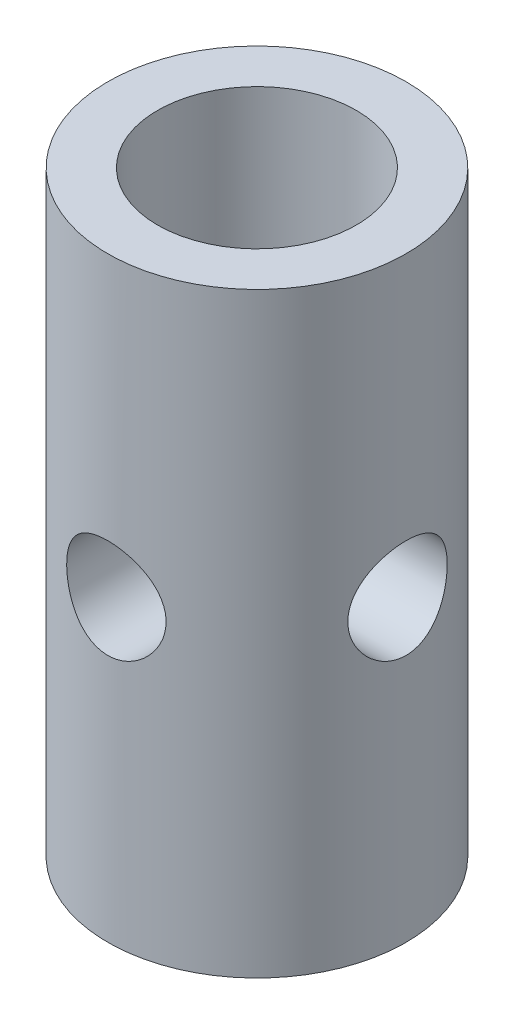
from build123d import *

# Parameters (mm, degrees)
ESQUISSE1_W                  = 7.5
ESQUISSE1_H                  = 30
ESQUISSE2_R                  = 5
ENL_V_MAT_EXTRU_1_DEPTH      = 12
ENL_V_MAT_EXTRU_2_DEPTH      = 32.819805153
ENL_V_MAT_EXTRU_2_DEPTH_BACK = 32.819805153
ESQUISSE3_R                  = 2.5
ENL_V_MAT_EXTRU_3_DEPTH      = 32.819805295
ENL_V_MAT_EXTRU_3_DEPTH_BACK = 32.819805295
ESQUISSE4_R                  = 2.5
ESQUISSE5_R                  = 2.5
ENL_V_MAT_EXTRU_4_DEPTH      = 32.819805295


with BuildPart() as part:
    # Esquisse1 → R_volution1 (revolve)
    with BuildSketch(Plane.XY, mode=Mode.PRIVATE) as r_volution1_sk:
        with Locations((-3.75, 15)):
            Rectangle(ESQUISSE1_W, ESQUISSE1_H)
    revolve(r_volution1_sk.sketch.rotate(Axis((0, -11.822342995, 0), (0, 1, 0)), 270), axis=Axis((0, -11.822342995, 0), (0, 1, 0)))

    # Esquisse2 → Enl_v. mat.-Extru.1 (cut)
    with BuildSketch(Plane(origin=(0, 30, 0), x_dir=(1, 0, 0), z_dir=(0, 1, 0))):
        with Locations(Location((0, 0, 0), (0, 0, 270))):
            Circle(ESQUISSE2_R)
    extrude(amount=-ENL_V_MAT_EXTRU_1_DEPTH, mode=Mode.SUBTRACT)

    # Esquisse3 → Enl_v. mat.-Extru.2 (cut, two sides: drawn at the far end of the back side and taken through both)
    with BuildSketch(Plane.XY.offset(-ENL_V_MAT_EXTRU_2_DEPTH_BACK)):
        with Locations((0, 15)):
            Circle(ESQUISSE3_R)
    extrude(amount=ENL_V_MAT_EXTRU_2_DEPTH + ENL_V_MAT_EXTRU_2_DEPTH_BACK, mode=Mode.SUBTRACT)

    # Esquisse4 → Enl_v. mat.-Extru.3 (cut, two sides: drawn at the far end of the back side and taken through both)
    with BuildSketch(Plane(origin=(0, 0, 0), x_dir=(0, 0, -1), z_dir=(1, 0, 0)).offset(-ENL_V_MAT_EXTRU_3_DEPTH_BACK)):
        with Locations((0, 15)):
            Circle(ESQUISSE4_R)
    extrude(amount=ENL_V_MAT_EXTRU_3_DEPTH + ENL_V_MAT_EXTRU_3_DEPTH_BACK, mode=Mode.SUBTRACT)

    # Esquisse5 → Enl_v. mat.-Extru.4 (cut, through all)
    with BuildSketch(Plane.XZ):
        with Locations(Location((0, 0, 0), (0, 0, 225))):
            Circle(ESQUISSE5_R)
    extrude(amount=-ENL_V_MAT_EXTRU_4_DEPTH, mode=Mode.SUBTRACT)


solid = part.part
